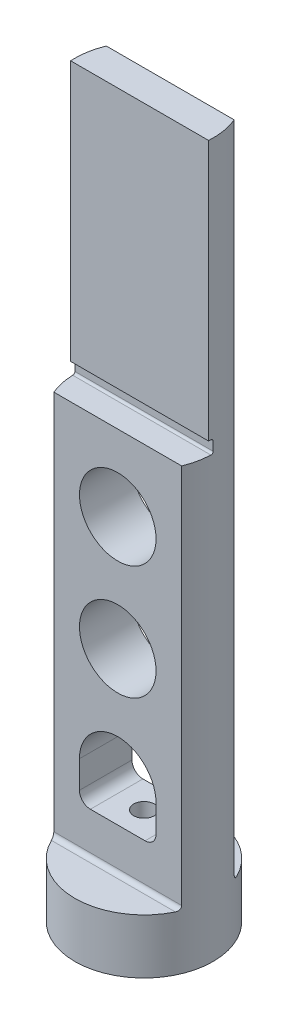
ISO-10303-21;
HEADER;
FILE_DESCRIPTION(('STEP AP214'),'2;1');
FILE_NAME('part.step','',(''),(''),'','','');
FILE_SCHEMA(('AUTOMOTIVE_DESIGN { 1 0 10303 214 1 1 1 1 }'));
ENDSEC;
DATA;
#1=APPLICATION_CONTEXT('core data for automotive mechanical design processes');
#2=APPLICATION_PROTOCOL_DEFINITION('international standard','automotive_design',2000,#1);
#3=PRODUCT_CONTEXT('',#1,'mechanical');
#4=PRODUCT('Part','Part','',(#3));
#5=PRODUCT_RELATED_PRODUCT_CATEGORY('part','',(#4));
#6=PRODUCT_DEFINITION_FORMATION('','',#4);
#7=PRODUCT_DEFINITION_CONTEXT('part definition',#1,'design');
#8=PRODUCT_DEFINITION('design','',#6,#7);
#9=PRODUCT_DEFINITION_SHAPE('','',#8);
#10=(LENGTH_UNIT() NAMED_UNIT(*) SI_UNIT(.MILLI.,.METRE.));
#11=(NAMED_UNIT(*) PLANE_ANGLE_UNIT() SI_UNIT($,.RADIAN.));
#12=(NAMED_UNIT(*) SI_UNIT($,.STERADIAN.) SOLID_ANGLE_UNIT());
#13=UNCERTAINTY_MEASURE_WITH_UNIT(LENGTH_MEASURE(1.E-05),#10,'distance_accuracy_value','');
#14=(GEOMETRIC_REPRESENTATION_CONTEXT(3) GLOBAL_UNCERTAINTY_ASSIGNED_CONTEXT((#13)) GLOBAL_UNIT_ASSIGNED_CONTEXT((#10,
#11,#12)) REPRESENTATION_CONTEXT('',''));
#15=CARTESIAN_POINT('',(0.,0.,0.));
#16=DIRECTION('',(0.,0.,1.));
#17=DIRECTION('',(1.,0.,0.));
#18=AXIS2_PLACEMENT_3D('',#15,#16,#17);
#19=CARTESIAN_POINT('',(0.,7.84225,-4.0132));
#20=DIRECTION('',(0.,0.,1.));
#21=DIRECTION('',(1.,0.,0.));
#22=AXIS2_PLACEMENT_3D('',#19,#20,#21);
#23=CYLINDRICAL_SURFACE('',#22,2.2225);
#24=DIRECTION('',(0.,0.,1.));
#25=VECTOR('',#24,1.);
#26=CARTESIAN_POINT('',(2.2225,7.84225,-4.0132));
#27=LINE('',#26,#25);
#28=CARTESIAN_POINT('',(2.2225,7.84225,-1.524));
#29=VERTEX_POINT('',#28);
#30=CARTESIAN_POINT('',(2.2225,7.84225,1.524));
#31=VERTEX_POINT('',#30);
#32=EDGE_CURVE('E450',#29,#31,#27,.T.);
#33=ORIENTED_EDGE('',*,*,#32,.T.);
#34=CARTESIAN_POINT('',(0.,7.84225,1.524));
#35=DIRECTION('',(0.,0.,1.));
#36=DIRECTION('',(1.,0.,0.));
#37=AXIS2_PLACEMENT_3D('',#34,#35,#36);
#38=CIRCLE('',#37,2.2225);
#39=CARTESIAN_POINT('',(-2.2225,7.84225,1.524));
#40=VERTEX_POINT('',#39);
#41=EDGE_CURVE('E430',#31,#40,#38,.T.);
#42=ORIENTED_EDGE('',*,*,#41,.T.);
#43=DIRECTION('',(0.,0.,1.));
#44=VECTOR('',#43,1.);
#45=CARTESIAN_POINT('',(-2.2225,7.84225,-4.0132));
#46=LINE('',#45,#44);
#47=CARTESIAN_POINT('',(-2.2225,7.84225,-1.524));
#48=VERTEX_POINT('',#47);
#49=EDGE_CURVE('E270',#40,#48,#46,.F.);
#50=ORIENTED_EDGE('',*,*,#49,.T.);
#51=CARTESIAN_POINT('',(0.,7.84225,-1.524));
#52=DIRECTION('',(0.,0.,-1.));
#53=DIRECTION('',(-1.,0.,0.));
#54=AXIS2_PLACEMENT_3D('',#51,#52,#53);
#55=CIRCLE('',#54,2.2225);
#56=EDGE_CURVE('E281',#48,#29,#55,.T.);
#57=ORIENTED_EDGE('',*,*,#56,.T.);
#58=EDGE_LOOP('',(#33,#42,#50,#57));
#59=FACE_BOUND('',#58,.T.);
#60=ADVANCED_FACE('F61',(#59),#23,.F.);
#61=CARTESIAN_POINT('',(0.,41.402,0.));
#62=DIRECTION('',(0.,1.,0.));
#63=DIRECTION('',(0.,0.,1.));
#64=AXIS2_PLACEMENT_3D('',#61,#62,#63);
#65=PLANE('',#64);
#66=DIRECTION('',(-1.,0.,0.));
#67=VECTOR('',#66,1.);
#68=CARTESIAN_POINT('',(0.,41.402,0.253999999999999));
#69=LINE('',#68,#67);
#70=CARTESIAN_POINT('',(4.00515395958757,41.402,0.253999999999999));
#71=VERTEX_POINT('',#70);
#72=CARTESIAN_POINT('',(-4.00515395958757,41.402,0.253999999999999));
#73=VERTEX_POINT('',#72);
#74=EDGE_CURVE('E419',#71,#73,#69,.T.);
#75=ORIENTED_EDGE('',*,*,#74,.F.);
#76=CARTESIAN_POINT('',(0.,41.402,0.));
#77=DIRECTION('',(0.,-1.,0.));
#78=DIRECTION('',(0.,0.,-1.));
#79=AXIS2_PLACEMENT_3D('',#76,#77,#78);
#80=CIRCLE('',#79,4.0132);
#81=CARTESIAN_POINT('',(3.71257299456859,41.402,-1.524));
#82=VERTEX_POINT('',#81);
#83=EDGE_CURVE('E427',#82,#71,#80,.T.);
#84=ORIENTED_EDGE('',*,*,#83,.F.);
#85=DIRECTION('',(1.,0.,0.));
#86=VECTOR('',#85,1.);
#87=CARTESIAN_POINT('',(0.,41.402,-1.524));
#88=LINE('',#87,#86);
#89=CARTESIAN_POINT('',(-3.71257299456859,41.402,-1.524));
#90=VERTEX_POINT('',#89);
#91=EDGE_CURVE('E365',#90,#82,#88,.T.);
#92=ORIENTED_EDGE('',*,*,#91,.F.);
#93=EDGE_CURVE('E277',#73,#90,#80,.T.);
#94=ORIENTED_EDGE('',*,*,#93,.F.);
#95=EDGE_LOOP('',(#75,#84,#92,#94));
#96=FACE_BOUND('',#95,.T.);
#97=ADVANCED_FACE('F324',(#96),#65,.T.);
#98=CARTESIAN_POINT('',(0.,41.402,1.524));
#99=DIRECTION('',(0.,0.,-1.));
#100=DIRECTION('',(-1.,0.,0.));
#101=AXIS2_PLACEMENT_3D('',#98,#99,#100);
#102=PLANE('',#101);
#103=CARTESIAN_POINT('',(0.,21.11375,1.524));
#104=DIRECTION('',(0.,0.,1.));
#105=DIRECTION('',(1.,0.,0.));
#106=AXIS2_PLACEMENT_3D('',#103,#104,#105);
#107=CIRCLE('',#106,2.2225);
#108=CARTESIAN_POINT('',(2.2225,21.11375,1.524));
#109=VERTEX_POINT('',#108);
#110=EDGE_CURVE('E284',#109,#109,#107,.T.);
#111=ORIENTED_EDGE('',*,*,#110,.F.);
#112=EDGE_LOOP('',(#111));
#113=FACE_BOUND('',#112,.T.);
#114=CARTESIAN_POINT('',(0.,14.478,1.524));
#115=DIRECTION('',(0.,0.,1.));
#116=DIRECTION('',(1.,0.,0.));
#117=AXIS2_PLACEMENT_3D('',#114,#115,#116);
#118=CIRCLE('',#117,2.2225);
#119=CARTESIAN_POINT('',(2.2225,14.478,1.524));
#120=VERTEX_POINT('',#119);
#121=EDGE_CURVE('E432',#120,#120,#118,.T.);
#122=ORIENTED_EDGE('',*,*,#121,.F.);
#123=EDGE_LOOP('',(#122));
#124=FACE_BOUND('',#123,.T.);
#125=DIRECTION('',(0.,1.,0.));
#126=VECTOR('',#125,1.);
#127=CARTESIAN_POINT('',(2.2225,0.,1.524));
#128=LINE('',#127,#126);
#129=CARTESIAN_POINT('',(2.2225,6.25475,1.524));
#130=VERTEX_POINT('',#129);
#131=EDGE_CURVE('E452',#130,#31,#128,.T.);
#132=ORIENTED_EDGE('',*,*,#131,.F.);
#133=CARTESIAN_POINT('',(1.5875,6.25475,1.524));
#134=DIRECTION('',(0.,0.,-1.));
#135=DIRECTION('',(-1.,0.,0.));
#136=AXIS2_PLACEMENT_3D('',#133,#134,#135);
#137=CIRCLE('',#136,0.635);
#138=CARTESIAN_POINT('',(1.5875,5.61975,1.524));
#139=VERTEX_POINT('',#138);
#140=EDGE_CURVE('E258',#130,#139,#137,.T.);
#141=ORIENTED_EDGE('',*,*,#140,.T.);
#142=DIRECTION('',(1.,0.,0.));
#143=VECTOR('',#142,1.);
#144=CARTESIAN_POINT('',(0.,5.61975,1.524));
#145=LINE('',#144,#143);
#146=CARTESIAN_POINT('',(-1.5875,5.61975,1.524));
#147=VERTEX_POINT('',#146);
#148=EDGE_CURVE('E442',#147,#139,#145,.T.);
#149=ORIENTED_EDGE('',*,*,#148,.F.);
#150=CARTESIAN_POINT('',(-1.5875,6.25475,1.524));
#151=DIRECTION('',(0.,0.,-1.));
#152=DIRECTION('',(-1.,0.,0.));
#153=AXIS2_PLACEMENT_3D('',#150,#151,#152);
#154=CIRCLE('',#153,0.635);
#155=CARTESIAN_POINT('',(-2.2225,6.25475,1.524));
#156=VERTEX_POINT('',#155);
#157=EDGE_CURVE('E91',#147,#156,#154,.T.);
#158=ORIENTED_EDGE('',*,*,#157,.T.);
#159=DIRECTION('',(0.,-1.,0.));
#160=VECTOR('',#159,1.);
#161=CARTESIAN_POINT('',(-2.2225,0.,1.524));
#162=LINE('',#161,#160);
#163=EDGE_CURVE('E445',#40,#156,#162,.T.);
#164=ORIENTED_EDGE('',*,*,#163,.F.);
#165=ORIENTED_EDGE('',*,*,#41,.F.);
#166=EDGE_LOOP('',(#132,#141,#149,#158,#164,#165));
#167=FACE_BOUND('',#166,.T.);
#168=DIRECTION('',(0.,-1.,0.));
#169=VECTOR('',#168,1.);
#170=CARTESIAN_POINT('',(3.71257299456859,41.402,1.524));
#171=LINE('',#170,#169);
#172=CARTESIAN_POINT('',(3.71257299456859,25.527,1.524));
#173=VERTEX_POINT('',#172);
#174=CARTESIAN_POINT('',(3.71257299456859,3.429,1.524));
#175=VERTEX_POINT('',#174);
#176=EDGE_CURVE('E383',#173,#175,#171,.T.);
#177=ORIENTED_EDGE('',*,*,#176,.F.);
#178=DIRECTION('',(1.,0.,0.));
#179=VECTOR('',#178,1.);
#180=CARTESIAN_POINT('',(0.,25.527,1.524));
#181=LINE('',#180,#179);
#182=CARTESIAN_POINT('',(-3.71257299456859,25.527,1.524));
#183=VERTEX_POINT('',#182);
#184=EDGE_CURVE('E418',#183,#173,#181,.T.);
#185=ORIENTED_EDGE('',*,*,#184,.F.);
#186=DIRECTION('',(0.,-1.,0.));
#187=VECTOR('',#186,1.);
#188=CARTESIAN_POINT('',(-3.71257299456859,41.402,1.524));
#189=LINE('',#188,#187);
#190=CARTESIAN_POINT('',(-3.71257299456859,3.429,1.524));
#191=VERTEX_POINT('',#190);
#192=EDGE_CURVE('E369',#183,#191,#189,.T.);
#193=ORIENTED_EDGE('',*,*,#192,.T.);
#194=DIRECTION('',(1.,0.,0.));
#195=VECTOR('',#194,1.);
#196=CARTESIAN_POINT('',(0.,3.429,1.524));
#197=LINE('',#196,#195);
#198=EDGE_CURVE('E391',#191,#175,#197,.T.);
#199=ORIENTED_EDGE('',*,*,#198,.T.);
#200=EDGE_LOOP('',(#177,#185,#193,#199));
#201=FACE_BOUND('',#200,.T.);
#202=ADVANCED_FACE('F330',(#113,#124,#167,#201),#102,.F.);
#203=CARTESIAN_POINT('',(0.,41.402,-1.524));
#204=DIRECTION('',(0.,0.,-1.));
#205=DIRECTION('',(-1.,0.,0.));
#206=AXIS2_PLACEMENT_3D('',#203,#204,#205);
#207=PLANE('',#206);
#208=DIRECTION('',(-1.,0.,0.));
#209=VECTOR('',#208,1.);
#210=CARTESIAN_POINT('',(0.,5.61975,-1.524));
#211=LINE('',#210,#209);
#212=CARTESIAN_POINT('',(1.5875,5.61975,-1.524));
#213=VERTEX_POINT('',#212);
#214=CARTESIAN_POINT('',(-1.5875,5.61975,-1.524));
#215=VERTEX_POINT('',#214);
#216=EDGE_CURVE('E439',#213,#215,#211,.T.);
#217=ORIENTED_EDGE('',*,*,#216,.F.);
#218=CARTESIAN_POINT('',(1.5875,6.25475,-1.524));
#219=DIRECTION('',(0.,0.,-1.));
#220=DIRECTION('',(-1.,0.,0.));
#221=AXIS2_PLACEMENT_3D('',#218,#219,#220);
#222=CIRCLE('',#221,0.635);
#223=CARTESIAN_POINT('',(2.2225,6.25475,-1.524));
#224=VERTEX_POINT('',#223);
#225=EDGE_CURVE('E256',#213,#224,#222,.F.);
#226=ORIENTED_EDGE('',*,*,#225,.T.);
#227=DIRECTION('',(0.,-1.,0.));
#228=VECTOR('',#227,1.);
#229=CARTESIAN_POINT('',(2.2225,41.402,-1.524));
#230=LINE('',#229,#228);
#231=EDGE_CURVE('E447',#29,#224,#230,.T.);
#232=ORIENTED_EDGE('',*,*,#231,.F.);
#233=ORIENTED_EDGE('',*,*,#56,.F.);
#234=DIRECTION('',(0.,1.,0.));
#235=VECTOR('',#234,1.);
#236=CARTESIAN_POINT('',(-2.2225,41.402,-1.524));
#237=LINE('',#236,#235);
#238=CARTESIAN_POINT('',(-2.2225,6.25475,-1.524));
#239=VERTEX_POINT('',#238);
#240=EDGE_CURVE('E433',#239,#48,#237,.T.);
#241=ORIENTED_EDGE('',*,*,#240,.F.);
#242=CARTESIAN_POINT('',(-1.5875,6.25475,-1.524));
#243=DIRECTION('',(0.,0.,-1.));
#244=DIRECTION('',(-1.,0.,0.));
#245=AXIS2_PLACEMENT_3D('',#242,#243,#244);
#246=CIRCLE('',#245,0.635);
#247=EDGE_CURVE('E253',#239,#215,#246,.F.);
#248=ORIENTED_EDGE('',*,*,#247,.T.);
#249=EDGE_LOOP('',(#217,#226,#232,#233,#241,#248));
#250=FACE_BOUND('',#249,.T.);
#251=CARTESIAN_POINT('',(0.,21.11375,-1.524));
#252=DIRECTION('',(0.,0.,-1.));
#253=DIRECTION('',(-1.,0.,0.));
#254=AXIS2_PLACEMENT_3D('',#251,#252,#253);
#255=CIRCLE('',#254,2.2225);
#256=CARTESIAN_POINT('',(-2.2225,21.11375,-1.524));
#257=VERTEX_POINT('',#256);
#258=EDGE_CURVE('E274',#257,#257,#255,.T.);
#259=ORIENTED_EDGE('',*,*,#258,.F.);
#260=EDGE_LOOP('',(#259));
#261=FACE_BOUND('',#260,.T.);
#262=CARTESIAN_POINT('',(0.,14.478,-1.524));
#263=DIRECTION('',(0.,0.,-1.));
#264=DIRECTION('',(-1.,0.,0.));
#265=AXIS2_PLACEMENT_3D('',#262,#263,#264);
#266=CIRCLE('',#265,2.2225);
#267=CARTESIAN_POINT('',(-2.2225,14.478,-1.524));
#268=VERTEX_POINT('',#267);
#269=EDGE_CURVE('E278',#268,#268,#266,.T.);
#270=ORIENTED_EDGE('',*,*,#269,.F.);
#271=EDGE_LOOP('',(#270));
#272=FACE_BOUND('',#271,.T.);
#273=ORIENTED_EDGE('',*,*,#91,.T.);
#274=DIRECTION('',(0.,-1.,0.));
#275=VECTOR('',#274,1.);
#276=CARTESIAN_POINT('',(3.71257299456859,41.402,-1.524));
#277=LINE('',#276,#275);
#278=CARTESIAN_POINT('',(3.71257299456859,3.429,-1.524));
#279=VERTEX_POINT('',#278);
#280=EDGE_CURVE('E380',#82,#279,#277,.T.);
#281=ORIENTED_EDGE('',*,*,#280,.T.);
#282=DIRECTION('',(1.,0.,0.));
#283=VECTOR('',#282,1.);
#284=CARTESIAN_POINT('',(-3.71257299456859,3.429,-1.524));
#285=LINE('',#284,#283);
#286=CARTESIAN_POINT('',(-3.71257299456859,3.429,-1.524));
#287=VERTEX_POINT('',#286);
#288=EDGE_CURVE('E389',#279,#287,#285,.F.);
#289=ORIENTED_EDGE('',*,*,#288,.T.);
#290=DIRECTION('',(0.,-1.,0.));
#291=VECTOR('',#290,1.);
#292=CARTESIAN_POINT('',(-3.71257299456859,41.402,-1.524));
#293=LINE('',#292,#291);
#294=EDGE_CURVE('E377',#90,#287,#293,.T.);
#295=ORIENTED_EDGE('',*,*,#294,.F.);
#296=EDGE_LOOP('',(#273,#281,#289,#295));
#297=FACE_BOUND('',#296,.T.);
#298=ADVANCED_FACE('F344',(#250,#261,#272,#297),#207,.T.);
#299=CARTESIAN_POINT('',(0.,25.527,0.253999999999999));
#300=DIRECTION('',(0.,-1.,0.));
#301=DIRECTION('',(0.,0.,-1.));
#302=AXIS2_PLACEMENT_3D('',#299,#300,#301);
#303=PLANE('',#302);
#304=CARTESIAN_POINT('',(0.,25.527,0.));
#305=DIRECTION('',(0.,-1.,0.));
#306=DIRECTION('',(0.,0.,-1.));
#307=AXIS2_PLACEMENT_3D('',#304,#305,#306);
#308=CIRCLE('',#307,4.0132);
#309=CARTESIAN_POINT('',(4.01119000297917,25.527,0.126999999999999));
#310=VERTEX_POINT('',#309);
#311=EDGE_CURVE('E424',#310,#173,#308,.T.);
#312=ORIENTED_EDGE('',*,*,#311,.F.);
#313=DIRECTION('',(1.,0.,0.));
#314=VECTOR('',#313,1.);
#315=CARTESIAN_POINT('',(-4.0132,25.527,0.126999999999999));
#316=LINE('',#315,#314);
#317=CARTESIAN_POINT('',(-4.01119000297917,25.527,0.126999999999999));
#318=VERTEX_POINT('',#317);
#319=EDGE_CURVE('E459',#318,#310,#316,.T.);
#320=ORIENTED_EDGE('',*,*,#319,.F.);
#321=EDGE_CURVE('E420',#183,#318,#308,.T.);
#322=ORIENTED_EDGE('',*,*,#321,.F.);
#323=ORIENTED_EDGE('',*,*,#184,.T.);
#324=EDGE_LOOP('',(#312,#320,#322,#323));
#325=FACE_BOUND('',#324,.T.);
#326=ADVANCED_FACE('F340',(#325),#303,.F.);
#327=CARTESIAN_POINT('',(0.,0.,0.253999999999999));
#328=DIRECTION('',(0.,0.,1.));
#329=DIRECTION('',(1.,0.,0.));
#330=AXIS2_PLACEMENT_3D('',#327,#328,#329);
#331=PLANE('',#330);
#332=DIRECTION('',(1.,0.,0.));
#333=VECTOR('',#332,1.);
#334=CARTESIAN_POINT('',(-4.0132,26.289,0.253999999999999));
#335=LINE('',#334,#333);
#336=CARTESIAN_POINT('',(-4.00515395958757,26.289,0.253999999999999));
#337=VERTEX_POINT('',#336);
#338=CARTESIAN_POINT('',(4.00515395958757,26.289,0.253999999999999));
#339=VERTEX_POINT('',#338);
#340=EDGE_CURVE('E458',#337,#339,#335,.T.);
#341=ORIENTED_EDGE('',*,*,#340,.T.);
#342=DIRECTION('',(0.,-1.,0.));
#343=VECTOR('',#342,1.);
#344=CARTESIAN_POINT('',(4.00515395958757,41.402,0.253999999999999));
#345=LINE('',#344,#343);
#346=EDGE_CURVE('E286',#339,#71,#345,.F.);
#347=ORIENTED_EDGE('',*,*,#346,.T.);
#348=ORIENTED_EDGE('',*,*,#74,.T.);
#349=DIRECTION('',(0.,-1.,0.));
#350=VECTOR('',#349,1.);
#351=CARTESIAN_POINT('',(-4.00515395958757,41.402,0.253999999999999));
#352=LINE('',#351,#350);
#353=EDGE_CURVE('E273',#73,#337,#352,.T.);
#354=ORIENTED_EDGE('',*,*,#353,.T.);
#355=EDGE_LOOP('',(#341,#347,#348,#354));
#356=FACE_BOUND('',#355,.T.);
#357=ADVANCED_FACE('F337',(#356),#331,.T.);
#358=CARTESIAN_POINT('',(0.,41.402,0.));
#359=DIRECTION('',(0.,-1.,0.));
#360=DIRECTION('',(0.,0.,-1.));
#361=AXIS2_PLACEMENT_3D('',#358,#359,#360);
#362=CYLINDRICAL_SURFACE('',#361,4.0132);
#363=ORIENTED_EDGE('',*,*,#346,.F.);
#364=CARTESIAN_POINT('',(0.,26.289,0.));
#365=DIRECTION('',(0.,1.,0.));
#366=DIRECTION('',(0.,0.,1.));
#367=AXIS2_PLACEMENT_3D('',#364,#365,#366);
#368=CIRCLE('',#367,4.0132);
#369=CARTESIAN_POINT('',(4.01119000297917,26.289,0.126999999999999));
#370=VERTEX_POINT('',#369);
#371=EDGE_CURVE('E12',#339,#370,#368,.T.);
#372=ORIENTED_EDGE('',*,*,#371,.T.);
#373=CARTESIAN_POINT('',(4.01119000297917,26.289,0.126999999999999));
#374=CARTESIAN_POINT('',(4.01141682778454,26.2890060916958,0.119859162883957));
#375=CARTESIAN_POINT('',(4.01162307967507,26.2883980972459,0.112719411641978));
#376=CARTESIAN_POINT('',(4.01199341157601,26.2859981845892,0.0986460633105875));
#377=CARTESIAN_POINT('',(4.01215752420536,26.2842071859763,0.0917123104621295));
#378=CARTESIAN_POINT('',(4.01244297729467,26.2794842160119,0.0782398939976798));
#379=CARTESIAN_POINT('',(4.0125642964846,26.2765516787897,0.0717014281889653));
#380=CARTESIAN_POINT('',(4.01276804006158,26.2696312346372,0.0592101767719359));
#381=CARTESIAN_POINT('',(4.01285047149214,26.2656435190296,0.0532572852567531));
#382=CARTESIAN_POINT('',(4.01298298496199,26.2567263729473,0.0421066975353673));
#383=CARTESIAN_POINT('',(4.01303307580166,26.2517971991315,0.0369087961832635));
#384=CARTESIAN_POINT('',(4.01310919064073,26.2411351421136,0.0274128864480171));
#385=CARTESIAN_POINT('',(4.01313520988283,26.2354021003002,0.0231150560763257));
#386=CARTESIAN_POINT('',(4.01317170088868,26.2232946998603,0.0155415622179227));
#387=CARTESIAN_POINT('',(4.01318216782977,26.2169201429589,0.0122662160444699));
#388=CARTESIAN_POINT('',(4.01319510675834,26.2037129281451,0.0068336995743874));
#389=CARTESIAN_POINT('',(4.01319758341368,26.1968805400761,0.00467587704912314));
#390=CARTESIAN_POINT('',(4.01319959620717,26.1853388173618,0.00207443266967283));
#391=CARTESIAN_POINT('',(4.01319984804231,26.1807019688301,0.00129699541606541));
#392=CARTESIAN_POINT('',(4.01320000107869,26.1713773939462,0.00025984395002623));
#393=CARTESIAN_POINT('',(4.01319990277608,26.1666897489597,-6.02005153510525E-07));
#394=CARTESIAN_POINT('',(4.01320000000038,26.1620000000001,-6.13837127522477E-13));
#395=B_SPLINE_CURVE_WITH_KNOTS('',3,(#373,#374,#375,#376,#377,#378,#379,#380,#381,#382,#383,
#384,#385,#386,#387,#388,#389,#390,#391,#392,#393,#394),.UNSPECIFIED.,.F.,.F.,(4,2,2,2,2,2,2,2,
2,2,4),(0.,0.0214049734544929,0.0427933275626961,0.0641922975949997,0.0855873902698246,
0.106976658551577,0.128370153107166,0.149770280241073,0.171157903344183,0.185235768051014,
0.199293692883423),.UNSPECIFIED.);
#396=CARTESIAN_POINT('',(4.0132,26.162,0.));
#397=VERTEX_POINT('',#396);
#398=EDGE_CURVE('E65',#370,#397,#395,.T.);
#399=ORIENTED_EDGE('',*,*,#398,.T.);
#400=DIRECTION('',(0.,1.,0.));
#401=VECTOR('',#400,1.);
#402=CARTESIAN_POINT('',(4.0132,26.162,0.));
#403=LINE('',#402,#401);
#404=CARTESIAN_POINT('',(4.0132,25.654,0.));
#405=VERTEX_POINT('',#404);
#406=EDGE_CURVE('E205',#405,#397,#403,.T.);
#407=ORIENTED_EDGE('',*,*,#406,.F.);
#408=CARTESIAN_POINT('',(4.0132,25.654,0.));
#409=CARTESIAN_POINT('',(4.01319945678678,25.6468552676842,-6.06817025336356E-06));
#410=CARTESIAN_POINT('',(4.01319999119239,25.6397123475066,0.000602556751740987));
#411=CARTESIAN_POINT('',(4.01319919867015,25.6256340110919,0.0030044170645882));
#412=CARTESIAN_POINT('',(4.01319787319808,25.6186984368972,0.00479672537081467));
#413=CARTESIAN_POINT('',(4.01318935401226,25.6052236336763,0.00952244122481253));
#414=CARTESIAN_POINT('',(4.01318215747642,25.5986845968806,0.0124563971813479));
#415=CARTESIAN_POINT('',(4.01315470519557,25.5861929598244,0.0193795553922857));
#416=CARTESIAN_POINT('',(4.01313445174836,25.5802402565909,0.0233685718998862));
#417=CARTESIAN_POINT('',(4.01307257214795,25.5690893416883,0.0322890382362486));
#418=CARTESIAN_POINT('',(4.01303094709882,25.5638910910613,0.0372204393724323));
#419=CARTESIAN_POINT('',(4.01291782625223,25.5543953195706,0.047886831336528));
#420=CARTESIAN_POINT('',(4.01284632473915,25.5500979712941,0.0536219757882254));
#421=CARTESIAN_POINT('',(4.0126662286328,25.5425273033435,0.0657313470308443));
#422=CARTESIAN_POINT('',(4.01255763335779,25.5392540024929,0.0721055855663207));
#423=CARTESIAN_POINT('',(4.01229856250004,25.5338254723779,0.0853110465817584));
#424=CARTESIAN_POINT('',(4.01214811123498,25.5316695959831,0.0921420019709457));
#425=CARTESIAN_POINT('',(4.01186315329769,25.5290712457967,0.103678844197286));
#426=CARTESIAN_POINT('',(4.01174078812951,25.5282949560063,0.108312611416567));
#427=CARTESIAN_POINT('',(4.0114784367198,25.5272593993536,0.117630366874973));
#428=CARTESIAN_POINT('',(4.01133847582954,25.5269993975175,0.122314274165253));
#429=CARTESIAN_POINT('',(4.01119000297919,25.5269999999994,0.126999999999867));
#430=B_SPLINE_CURVE_WITH_KNOTS('',3,(#408,#409,#410,#411,#412,#413,#414,#415,#416,#417,#418,
#419,#420,#421,#422,#423,#424,#425,#426,#427,#428,#429),.UNSPECIFIED.,.F.,.F.,(4,2,2,2,2,2,2,2,
2,2,4),(0.,0.021405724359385,0.0427947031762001,0.0641939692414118,0.085589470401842,
0.106983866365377,0.128382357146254,0.149781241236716,0.171167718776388,0.185240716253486,
0.19929366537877),.UNSPECIFIED.);
#431=EDGE_CURVE('E247',#405,#310,#430,.T.);
#432=ORIENTED_EDGE('',*,*,#431,.T.);
#433=ORIENTED_EDGE('',*,*,#311,.T.);
#434=ORIENTED_EDGE('',*,*,#176,.T.);
#435=CARTESIAN_POINT('',(3.71257299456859,3.429,1.524));
#436=CARTESIAN_POINT('',(3.71257715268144,3.41551927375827,1.52398474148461));
#437=CARTESIAN_POINT('',(3.71213285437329,3.40204735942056,1.52507217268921));
#438=CARTESIAN_POINT('',(3.7103801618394,3.37553056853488,1.52933406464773));
#439=CARTESIAN_POINT('',(3.70907403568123,3.36248466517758,1.53250304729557));
#440=CARTESIAN_POINT('',(3.70563044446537,3.33715651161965,1.54081021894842));
#441=CARTESIAN_POINT('',(3.7034930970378,3.32487415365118,1.54594812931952));
#442=CARTESIAN_POINT('',(3.6984428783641,3.3013816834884,1.55799142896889));
#443=CARTESIAN_POINT('',(3.69552974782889,3.29017193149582,1.56489740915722));
#444=CARTESIAN_POINT('',(3.68890971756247,3.26879495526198,1.58044053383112));
#445=CARTESIAN_POINT('',(3.68518340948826,3.25866431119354,1.58911959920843));
#446=CARTESIAN_POINT('',(3.67707618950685,3.24000570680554,1.6077899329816));
#447=CARTESIAN_POINT('',(3.67269517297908,3.23147800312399,1.61778141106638));
#448=CARTESIAN_POINT('',(3.66304461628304,3.21561492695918,1.63952104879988));
#449=CARTESIAN_POINT('',(3.65773416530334,3.20840639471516,1.65134345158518));
#450=CARTESIAN_POINT('',(3.64659200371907,3.19606199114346,1.67580490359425));
#451=CARTESIAN_POINT('',(3.64075986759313,3.19092783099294,1.68844461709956));
#452=CARTESIAN_POINT('',(3.6288710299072,3.18288545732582,1.71384340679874));
#453=CARTESIAN_POINT('',(3.62282511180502,3.17991921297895,1.72658934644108));
#454=CARTESIAN_POINT('',(3.61049079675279,3.17597687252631,1.75223774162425));
#455=CARTESIAN_POINT('',(3.60420293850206,3.17499658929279,1.76513981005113));
#456=CARTESIAN_POINT('',(3.59784522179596,3.175,1.778));
#457=B_SPLINE_CURVE_WITH_KNOTS('',3,(#435,#436,#437,#438,#439,#440,#441,#442,#443,#444,#445,
#446,#447,#448,#449,#450,#451,#452,#453,#454,#455,#456),.UNSPECIFIED.,.F.,.F.,(4,2,2,2,2,2,2,2,
2,2,4),(0.,0.0403774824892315,0.0806491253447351,0.120915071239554,0.161194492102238,
0.202567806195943,0.243947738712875,0.288251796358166,0.332592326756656,0.375697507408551,
0.418711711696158),.UNSPECIFIED.);
#458=CARTESIAN_POINT('',(3.59784522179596,3.175,1.778));
#459=VERTEX_POINT('',#458);
#460=EDGE_CURVE('E295',#175,#459,#457,.T.);
#461=ORIENTED_EDGE('',*,*,#460,.T.);
#462=CARTESIAN_POINT('',(0.,3.175,0.));
#463=DIRECTION('',(0.,1.,0.));
#464=DIRECTION('',(0.,0.,1.));
#465=AXIS2_PLACEMENT_3D('',#462,#463,#464);
#466=CIRCLE('',#465,4.0132);
#467=CARTESIAN_POINT('',(-3.59784522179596,3.175,1.778));
#468=VERTEX_POINT('',#467);
#469=EDGE_CURVE('E366',#468,#459,#466,.T.);
#470=ORIENTED_EDGE('',*,*,#469,.F.);
#471=CARTESIAN_POINT('',(-3.59784522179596,3.175,1.778));
#472=CARTESIAN_POINT('',(-3.60536795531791,3.17499223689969,1.76278719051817));
#473=CARTESIAN_POINT('',(-3.6127930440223,3.17636711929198,1.74750982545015));
#474=CARTESIAN_POINT('',(-3.62728220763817,3.18189776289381,1.7172278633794));
#475=CARTESIAN_POINT('',(-3.6343449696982,3.18606296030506,1.70222437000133));
#476=CARTESIAN_POINT('',(-3.64790582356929,3.19720297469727,1.67296752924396));
#477=CARTESIAN_POINT('',(-3.6544025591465,3.20418432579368,1.65871601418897));
#478=CARTESIAN_POINT('',(-3.66661230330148,3.22086247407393,1.63154816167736));
#479=CARTESIAN_POINT('',(-3.67232654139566,3.23055493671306,1.61862973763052));
#480=CARTESIAN_POINT('',(-3.68242307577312,3.25167462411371,1.59551957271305));
#481=CARTESIAN_POINT('',(-3.68687122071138,3.26292930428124,1.585199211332));
#482=CARTESIAN_POINT('',(-3.69480458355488,3.28733502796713,1.56661919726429));
#483=CARTESIAN_POINT('',(-3.69828984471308,3.30048598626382,1.55835945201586));
#484=CARTESIAN_POINT('',(-3.7039133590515,3.32701309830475,1.54494283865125));
#485=CARTESIAN_POINT('',(-3.7061445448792,3.34026270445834,1.5395737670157));
#486=CARTESIAN_POINT('',(-3.70964303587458,3.36758133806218,1.53112509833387));
#487=CARTESIAN_POINT('',(-3.71091213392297,3.38164878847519,1.52804124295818));
#488=CARTESIAN_POINT('',(-3.71197915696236,3.40137150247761,1.52544595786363));
#489=CARTESIAN_POINT('',(-3.71220190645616,3.40688535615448,1.52490373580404));
#490=CARTESIAN_POINT('',(-3.71249863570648,3.41793185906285,1.52418117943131));
#491=CARTESIAN_POINT('',(-3.71257285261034,3.42346446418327,1.52400026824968));
#492=CARTESIAN_POINT('',(-3.71257299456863,3.429,1.52399999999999));
#493=B_SPLINE_CURVE_WITH_KNOTS('',3,(#471,#472,#473,#474,#475,#476,#477,#478,#479,#480,#481,
#482,#483,#484,#485,#486,#487,#488,#489,#490,#491,#492),.UNSPECIFIED.,.F.,.F.,(4,2,2,2,2,2,2,2,
2,2,4),(0.,0.0508807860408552,0.101934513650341,0.153107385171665,0.20419890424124,
0.251654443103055,0.299107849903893,0.342294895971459,0.385401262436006,0.402025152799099,
0.418622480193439),.UNSPECIFIED.);
#494=EDGE_CURVE('E288',#468,#191,#493,.T.);
#495=ORIENTED_EDGE('',*,*,#494,.T.);
#496=ORIENTED_EDGE('',*,*,#192,.F.);
#497=ORIENTED_EDGE('',*,*,#321,.T.);
#498=CARTESIAN_POINT('',(-4.01119000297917,25.527,0.126999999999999));
#499=CARTESIAN_POINT('',(-4.01141682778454,25.5269939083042,0.119859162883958));
#500=CARTESIAN_POINT('',(-4.01162307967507,25.5276019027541,0.112719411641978));
#501=CARTESIAN_POINT('',(-4.01199341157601,25.5300018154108,0.0986460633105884));
#502=CARTESIAN_POINT('',(-4.01215752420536,25.5317928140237,0.0917123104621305));
#503=CARTESIAN_POINT('',(-4.01244297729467,25.5365157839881,0.0782398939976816));
#504=CARTESIAN_POINT('',(-4.0125642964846,25.5394483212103,0.0717014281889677));
#505=CARTESIAN_POINT('',(-4.01276804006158,25.5463687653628,0.0592101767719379));
#506=CARTESIAN_POINT('',(-4.01285047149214,25.5503564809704,0.0532572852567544));
#507=CARTESIAN_POINT('',(-4.01298298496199,25.5592736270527,0.0421066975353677));
#508=CARTESIAN_POINT('',(-4.01303307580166,25.5642028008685,0.0369087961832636));
#509=CARTESIAN_POINT('',(-4.01310919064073,25.5748648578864,0.027412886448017));
#510=CARTESIAN_POINT('',(-4.01313520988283,25.5805978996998,0.0231150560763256));
#511=CARTESIAN_POINT('',(-4.01317170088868,25.5927053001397,0.0155415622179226));
#512=CARTESIAN_POINT('',(-4.01318216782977,25.5990798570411,0.0122662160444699));
#513=CARTESIAN_POINT('',(-4.01319510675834,25.6122870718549,0.00683369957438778));
#514=CARTESIAN_POINT('',(-4.01319758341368,25.6191194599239,0.00467587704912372));
#515=CARTESIAN_POINT('',(-4.01319959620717,25.6306611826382,0.00207443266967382));
#516=CARTESIAN_POINT('',(-4.01319984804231,25.6352980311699,0.00129699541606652));
#517=CARTESIAN_POINT('',(-4.01320000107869,25.6446226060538,0.00025984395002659));
#518=CARTESIAN_POINT('',(-4.01319990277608,25.6493102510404,-6.02005153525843E-07));
#519=CARTESIAN_POINT('',(-4.01320000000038,25.6539999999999,-6.13966311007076E-13));
#520=B_SPLINE_CURVE_WITH_KNOTS('',3,(#498,#499,#500,#501,#502,#503,#504,#505,#506,#507,#508,
#509,#510,#511,#512,#513,#514,#515,#516,#517,#518,#519),.UNSPECIFIED.,.F.,.F.,(4,2,2,2,2,2,2,2,
2,2,4),(0.,0.0214049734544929,0.042793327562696,0.0641922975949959,0.0855873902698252,
0.106976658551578,0.128370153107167,0.149770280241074,0.17115790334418,0.185235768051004,
0.199293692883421),.UNSPECIFIED.);
#521=CARTESIAN_POINT('',(-4.0132,25.654,0.));
#522=VERTEX_POINT('',#521);
#523=EDGE_CURVE('E216',#318,#522,#520,.T.);
#524=ORIENTED_EDGE('',*,*,#523,.T.);
#525=DIRECTION('',(0.,1.,0.));
#526=VECTOR('',#525,1.);
#527=CARTESIAN_POINT('',(-4.0132,26.162,0.));
#528=LINE('',#527,#526);
#529=CARTESIAN_POINT('',(-4.0132,26.162,0.));
#530=VERTEX_POINT('',#529);
#531=EDGE_CURVE('E209',#522,#530,#528,.T.);
#532=ORIENTED_EDGE('',*,*,#531,.T.);
#533=CARTESIAN_POINT('',(-4.0132,26.162,0.));
#534=CARTESIAN_POINT('',(-4.01319945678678,26.1691447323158,-6.06817025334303E-06));
#535=CARTESIAN_POINT('',(-4.01319999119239,26.1762876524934,0.000602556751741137));
#536=CARTESIAN_POINT('',(-4.01319919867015,26.1903659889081,0.00300441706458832));
#537=CARTESIAN_POINT('',(-4.01319787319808,26.1973015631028,0.00479672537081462));
#538=CARTESIAN_POINT('',(-4.01318935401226,26.2107763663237,0.00952244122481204));
#539=CARTESIAN_POINT('',(-4.01318215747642,26.2173154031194,0.0124563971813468));
#540=CARTESIAN_POINT('',(-4.01315470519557,26.2298070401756,0.0193795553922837));
#541=CARTESIAN_POINT('',(-4.01313445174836,26.2357597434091,0.0233685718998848));
#542=CARTESIAN_POINT('',(-4.01307257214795,26.2469106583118,0.032289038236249));
#543=CARTESIAN_POINT('',(-4.01303094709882,26.2521089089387,0.0372204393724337));
#544=CARTESIAN_POINT('',(-4.01291782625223,26.2616046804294,0.0478868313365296));
#545=CARTESIAN_POINT('',(-4.01284632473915,26.2659020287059,0.0536219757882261));
#546=CARTESIAN_POINT('',(-4.0126662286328,26.2734726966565,0.0657313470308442));
#547=CARTESIAN_POINT('',(-4.01255763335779,26.2767459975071,0.0721055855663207));
#548=CARTESIAN_POINT('',(-4.01229856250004,26.2821745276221,0.0853110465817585));
#549=CARTESIAN_POINT('',(-4.01214811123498,26.2843304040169,0.0921420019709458));
#550=CARTESIAN_POINT('',(-4.01186315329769,26.2869287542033,0.103678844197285));
#551=CARTESIAN_POINT('',(-4.01174078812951,26.2877050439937,0.108312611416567));
#552=CARTESIAN_POINT('',(-4.0114784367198,26.2887406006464,0.117630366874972));
#553=CARTESIAN_POINT('',(-4.01133847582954,26.2890006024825,0.122314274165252));
#554=CARTESIAN_POINT('',(-4.01119000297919,26.2890000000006,0.126999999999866));
#555=B_SPLINE_CURVE_WITH_KNOTS('',3,(#533,#534,#535,#536,#537,#538,#539,#540,#541,#542,#543,
#544,#545,#546,#547,#548,#549,#550,#551,#552,#553,#554),.UNSPECIFIED.,.F.,.F.,(4,2,2,2,2,2,2,2,
2,2,4),(0.,0.0214057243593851,0.0427947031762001,0.0641939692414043,0.0855894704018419,
0.106983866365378,0.128382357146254,0.149781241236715,0.171167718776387,0.185240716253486,
0.199293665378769),.UNSPECIFIED.);
#556=CARTESIAN_POINT('',(-4.01119000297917,26.289,0.126999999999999));
#557=VERTEX_POINT('',#556);
#558=EDGE_CURVE('E200',#530,#557,#555,.T.);
#559=ORIENTED_EDGE('',*,*,#558,.T.);
#560=EDGE_CURVE('E76',#557,#337,#368,.T.);
#561=ORIENTED_EDGE('',*,*,#560,.T.);
#562=ORIENTED_EDGE('',*,*,#353,.F.);
#563=ORIENTED_EDGE('',*,*,#93,.T.);
#564=ORIENTED_EDGE('',*,*,#294,.T.);
#565=CARTESIAN_POINT('',(-3.71257299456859,3.429,-1.524));
#566=CARTESIAN_POINT('',(-3.71257715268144,3.41551927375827,-1.52398474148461));
#567=CARTESIAN_POINT('',(-3.71213285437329,3.40204735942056,-1.52507217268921));
#568=CARTESIAN_POINT('',(-3.7103801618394,3.37553056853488,-1.52933406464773));
#569=CARTESIAN_POINT('',(-3.70907403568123,3.36248466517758,-1.53250304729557));
#570=CARTESIAN_POINT('',(-3.70563044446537,3.33715651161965,-1.54081021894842));
#571=CARTESIAN_POINT('',(-3.7034930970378,3.32487415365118,-1.54594812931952));
#572=CARTESIAN_POINT('',(-3.6984428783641,3.3013816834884,-1.5579914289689));
#573=CARTESIAN_POINT('',(-3.69552974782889,3.29017193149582,-1.56489740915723));
#574=CARTESIAN_POINT('',(-3.68890971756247,3.26879495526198,-1.58044053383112));
#575=CARTESIAN_POINT('',(-3.68518340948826,3.25866431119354,-1.58911959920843));
#576=CARTESIAN_POINT('',(-3.67707618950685,3.24000570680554,-1.6077899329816));
#577=CARTESIAN_POINT('',(-3.67269517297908,3.23147800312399,-1.61778141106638));
#578=CARTESIAN_POINT('',(-3.66304461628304,3.21561492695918,-1.63952104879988));
#579=CARTESIAN_POINT('',(-3.65773416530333,3.20840639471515,-1.65134345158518));
#580=CARTESIAN_POINT('',(-3.64659200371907,3.19606199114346,-1.67580490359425));
#581=CARTESIAN_POINT('',(-3.64075986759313,3.19092783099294,-1.68844461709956));
#582=CARTESIAN_POINT('',(-3.6288710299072,3.18288545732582,-1.71384340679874));
#583=CARTESIAN_POINT('',(-3.62282511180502,3.17991921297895,-1.72658934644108));
#584=CARTESIAN_POINT('',(-3.61049079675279,3.17597687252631,-1.75223774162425));
#585=CARTESIAN_POINT('',(-3.60420293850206,3.17499658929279,-1.76513981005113));
#586=CARTESIAN_POINT('',(-3.59784522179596,3.175,-1.778));
#587=B_SPLINE_CURVE_WITH_KNOTS('',3,(#565,#566,#567,#568,#569,#570,#571,#572,#573,#574,#575,
#576,#577,#578,#579,#580,#581,#582,#583,#584,#585,#586),.UNSPECIFIED.,.F.,.F.,(4,2,2,2,2,2,2,2,
2,2,4),(0.,0.0403774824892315,0.0806491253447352,0.120915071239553,0.161194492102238,
0.202567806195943,0.243947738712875,0.288251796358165,0.332592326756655,0.375697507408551,
0.418711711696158),.UNSPECIFIED.);
#588=CARTESIAN_POINT('',(-3.59784522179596,3.175,-1.778));
#589=VERTEX_POINT('',#588);
#590=EDGE_CURVE('E401',#287,#589,#587,.T.);
#591=ORIENTED_EDGE('',*,*,#590,.T.);
#592=CARTESIAN_POINT('',(3.59784522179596,3.175,-1.778));
#593=VERTEX_POINT('',#592);
#594=EDGE_CURVE('E372',#593,#589,#466,.T.);
#595=ORIENTED_EDGE('',*,*,#594,.F.);
#596=CARTESIAN_POINT('',(3.59784522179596,3.175,-1.778));
#597=CARTESIAN_POINT('',(3.60536795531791,3.17499223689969,-1.76278719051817));
#598=CARTESIAN_POINT('',(3.6127930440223,3.17636711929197,-1.74750982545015));
#599=CARTESIAN_POINT('',(3.62728220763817,3.1818977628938,-1.7172278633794));
#600=CARTESIAN_POINT('',(3.6343449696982,3.18606296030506,-1.70222437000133));
#601=CARTESIAN_POINT('',(3.64790582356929,3.19720297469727,-1.67296752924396));
#602=CARTESIAN_POINT('',(3.6544025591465,3.20418432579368,-1.65871601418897));
#603=CARTESIAN_POINT('',(3.66661230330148,3.22086247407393,-1.63154816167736));
#604=CARTESIAN_POINT('',(3.67232654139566,3.23055493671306,-1.61862973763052));
#605=CARTESIAN_POINT('',(3.68242307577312,3.2516746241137,-1.59551957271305));
#606=CARTESIAN_POINT('',(3.68687122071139,3.26292930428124,-1.585199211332));
#607=CARTESIAN_POINT('',(3.69480458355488,3.28733502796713,-1.56661919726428));
#608=CARTESIAN_POINT('',(3.69828984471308,3.30048598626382,-1.55835945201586));
#609=CARTESIAN_POINT('',(3.7039133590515,3.32701309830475,-1.54494283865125));
#610=CARTESIAN_POINT('',(3.7061445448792,3.34026270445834,-1.5395737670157));
#611=CARTESIAN_POINT('',(3.70964303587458,3.36758133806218,-1.53112509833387));
#612=CARTESIAN_POINT('',(3.71091213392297,3.38164878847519,-1.52804124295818));
#613=CARTESIAN_POINT('',(3.71197915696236,3.40137150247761,-1.52544595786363));
#614=CARTESIAN_POINT('',(3.71220190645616,3.40688535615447,-1.52490373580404));
#615=CARTESIAN_POINT('',(3.71249863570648,3.41793185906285,-1.5241811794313));
#616=CARTESIAN_POINT('',(3.71257285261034,3.42346446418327,-1.52400026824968));
#617=CARTESIAN_POINT('',(3.71257299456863,3.429,-1.52399999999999));
#618=B_SPLINE_CURVE_WITH_KNOTS('',3,(#596,#597,#598,#599,#600,#601,#602,#603,#604,#605,#606,
#607,#608,#609,#610,#611,#612,#613,#614,#615,#616,#617),.UNSPECIFIED.,.F.,.F.,(4,2,2,2,2,2,2,2,
2,2,4),(0.,0.0508807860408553,0.10193451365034,0.153107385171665,0.204198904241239,
0.251654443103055,0.299107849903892,0.342294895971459,0.385401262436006,0.402025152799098,
0.418622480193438),.UNSPECIFIED.);
#619=EDGE_CURVE('E396',#593,#279,#618,.T.);
#620=ORIENTED_EDGE('',*,*,#619,.T.);
#621=ORIENTED_EDGE('',*,*,#280,.F.);
#622=ORIENTED_EDGE('',*,*,#83,.T.);
#623=EDGE_LOOP('',(#363,#372,#399,#407,#432,#433,#434,#461,#470,#495,#496,#497,#524,#532,#559,
#561,#562,#563,#564,#591,#595,#620,#621,#622));
#624=FACE_BOUND('',#623,.T.);
#625=CARTESIAN_POINT('',(0.,0.,0.));
#626=DIRECTION('',(0.,1.,0.));
#627=DIRECTION('',(0.,0.,1.));
#628=AXIS2_PLACEMENT_3D('',#625,#626,#627);
#629=CIRCLE('',#628,4.0132);
#630=CARTESIAN_POINT('',(0.,0.,4.0132));
#631=VERTEX_POINT('',#630);
#632=EDGE_CURVE('E364',#631,#631,#629,.T.);
#633=ORIENTED_EDGE('',*,*,#632,.T.);
#634=EDGE_LOOP('',(#633));
#635=FACE_BOUND('',#634,.T.);
#636=ADVANCED_FACE('F212',(#624,#635),#362,.T.);
#637=CARTESIAN_POINT('',(0.,0.,0.));
#638=DIRECTION('',(0.,1.,0.));
#639=DIRECTION('',(0.,0.,1.));
#640=AXIS2_PLACEMENT_3D('',#637,#638,#639);
#641=PLANE('',#640);
#642=CARTESIAN_POINT('',(0.,0.,0.));
#643=DIRECTION('',(0.,-1.,0.));
#644=DIRECTION('',(0.,0.,-1.));
#645=AXIS2_PLACEMENT_3D('',#642,#643,#644);
#646=CIRCLE('',#645,0.595629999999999);
#647=CARTESIAN_POINT('',(0.,0.,-0.595629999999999));
#648=VERTEX_POINT('',#647);
#649=EDGE_CURVE('E361',#648,#648,#646,.T.);
#650=ORIENTED_EDGE('',*,*,#649,.F.);
#651=EDGE_LOOP('',(#650));
#652=FACE_BOUND('',#651,.T.);
#653=ORIENTED_EDGE('',*,*,#632,.F.);
#654=EDGE_LOOP('',(#653));
#655=FACE_BOUND('',#654,.T.);
#656=ADVANCED_FACE('F350',(#652,#655),#641,.F.);
#657=CARTESIAN_POINT('',(0.,3.175,0.));
#658=DIRECTION('',(0.,1.,0.));
#659=DIRECTION('',(0.,0.,1.));
#660=AXIS2_PLACEMENT_3D('',#657,#658,#659);
#661=PLANE('',#660);
#662=ORIENTED_EDGE('',*,*,#594,.T.);
#663=DIRECTION('',(1.,0.,0.));
#664=VECTOR('',#663,1.);
#665=CARTESIAN_POINT('',(3.71257299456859,3.175,-1.778));
#666=LINE('',#665,#664);
#667=EDGE_CURVE('E386',#589,#593,#666,.T.);
#668=ORIENTED_EDGE('',*,*,#667,.T.);
#669=EDGE_LOOP('',(#662,#668));
#670=FACE_BOUND('',#669,.T.);
#671=ADVANCED_FACE('F348',(#670),#661,.T.);
#672=ORIENTED_EDGE('',*,*,#469,.T.);
#673=DIRECTION('',(1.,0.,0.));
#674=VECTOR('',#673,1.);
#675=CARTESIAN_POINT('',(0.,3.175,1.778));
#676=LINE('',#675,#674);
#677=EDGE_CURVE('E394',#459,#468,#676,.F.);
#678=ORIENTED_EDGE('',*,*,#677,.T.);
#679=EDGE_LOOP('',(#672,#678));
#680=FACE_BOUND('',#679,.T.);
#681=ADVANCED_FACE('F346',(#680),#661,.T.);
#682=CARTESIAN_POINT('',(0.,3.429,-1.778));
#683=DIRECTION('',(-1.,0.,0.));
#684=DIRECTION('',(0.,0.,1.));
#685=AXIS2_PLACEMENT_3D('',#682,#683,#684);
#686=CYLINDRICAL_SURFACE('',#685,0.254);
#687=ORIENTED_EDGE('',*,*,#590,.F.);
#688=ORIENTED_EDGE('',*,*,#288,.F.);
#689=ORIENTED_EDGE('',*,*,#619,.F.);
#690=ORIENTED_EDGE('',*,*,#667,.F.);
#691=EDGE_LOOP('',(#687,#688,#689,#690));
#692=FACE_BOUND('',#691,.T.);
#693=ADVANCED_FACE('F306',(#692),#686,.F.);
#694=CARTESIAN_POINT('',(0.,3.429,1.778));
#695=DIRECTION('',(1.,0.,0.));
#696=DIRECTION('',(0.,0.,-1.));
#697=AXIS2_PLACEMENT_3D('',#694,#695,#696);
#698=CYLINDRICAL_SURFACE('',#697,0.254);
#699=ORIENTED_EDGE('',*,*,#494,.F.);
#700=ORIENTED_EDGE('',*,*,#677,.F.);
#701=ORIENTED_EDGE('',*,*,#460,.F.);
#702=ORIENTED_EDGE('',*,*,#198,.F.);
#703=EDGE_LOOP('',(#699,#700,#701,#702));
#704=FACE_BOUND('',#703,.T.);
#705=ADVANCED_FACE('F301',(#704),#698,.F.);
#706=CARTESIAN_POINT('',(0.,14.478,-4.0132));
#707=DIRECTION('',(0.,0.,1.));
#708=DIRECTION('',(1.,0.,0.));
#709=AXIS2_PLACEMENT_3D('',#706,#707,#708);
#710=CYLINDRICAL_SURFACE('',#709,2.2225);
#711=ORIENTED_EDGE('',*,*,#269,.T.);
#712=EDGE_LOOP('',(#711));
#713=FACE_BOUND('',#712,.T.);
#714=ORIENTED_EDGE('',*,*,#121,.T.);
#715=EDGE_LOOP('',(#714));
#716=FACE_BOUND('',#715,.T.);
#717=ADVANCED_FACE('F305',(#713,#716),#710,.F.);
#718=CARTESIAN_POINT('',(0.,21.11375,-4.0132));
#719=DIRECTION('',(0.,0.,1.));
#720=DIRECTION('',(1.,0.,0.));
#721=AXIS2_PLACEMENT_3D('',#718,#719,#720);
#722=CYLINDRICAL_SURFACE('',#721,2.2225);
#723=ORIENTED_EDGE('',*,*,#258,.T.);
#724=EDGE_LOOP('',(#723));
#725=FACE_BOUND('',#724,.T.);
#726=ORIENTED_EDGE('',*,*,#110,.T.);
#727=EDGE_LOOP('',(#726));
#728=FACE_BOUND('',#727,.T.);
#729=ADVANCED_FACE('F493',(#725,#728),#722,.F.);
#730=CARTESIAN_POINT('',(-2.2225,0.,-4.0132));
#731=DIRECTION('',(-1.,0.,0.));
#732=DIRECTION('',(0.,0.,1.));
#733=AXIS2_PLACEMENT_3D('',#730,#731,#732);
#734=PLANE('',#733);
#735=ORIENTED_EDGE('',*,*,#163,.T.);
#736=DIRECTION('',(0.,0.,1.));
#737=VECTOR('',#736,1.);
#738=CARTESIAN_POINT('',(-2.2225,6.25475,-1.524));
#739=LINE('',#738,#737);
#740=EDGE_CURVE('E260',#156,#239,#739,.F.);
#741=ORIENTED_EDGE('',*,*,#740,.T.);
#742=ORIENTED_EDGE('',*,*,#240,.T.);
#743=ORIENTED_EDGE('',*,*,#49,.F.);
#744=EDGE_LOOP('',(#735,#741,#742,#743));
#745=FACE_BOUND('',#744,.T.);
#746=ADVANCED_FACE('F509',(#745),#734,.F.);
#747=CARTESIAN_POINT('',(0.,5.61975,-4.0132));
#748=DIRECTION('',(0.,-1.,0.));
#749=DIRECTION('',(0.,0.,-1.));
#750=AXIS2_PLACEMENT_3D('',#747,#748,#749);
#751=PLANE('',#750);
#752=CARTESIAN_POINT('',(0.,5.61975,0.));
#753=DIRECTION('',(0.,-1.,0.));
#754=DIRECTION('',(0.,0.,-1.));
#755=AXIS2_PLACEMENT_3D('',#752,#753,#754);
#756=CIRCLE('',#755,0.595629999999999);
#757=CARTESIAN_POINT('',(0.,5.61975,-0.595629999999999));
#758=VERTEX_POINT('',#757);
#759=EDGE_CURVE('E454',#758,#758,#756,.T.);
#760=ORIENTED_EDGE('',*,*,#759,.T.);
#761=EDGE_LOOP('',(#760));
#762=FACE_BOUND('',#761,.T.);
#763=ORIENTED_EDGE('',*,*,#148,.T.);
#764=DIRECTION('',(0.,0.,1.));
#765=VECTOR('',#764,1.);
#766=CARTESIAN_POINT('',(1.5875,5.61975,-1.524));
#767=LINE('',#766,#765);
#768=EDGE_CURVE('E262',#139,#213,#767,.F.);
#769=ORIENTED_EDGE('',*,*,#768,.T.);
#770=ORIENTED_EDGE('',*,*,#216,.T.);
#771=DIRECTION('',(0.,0.,1.));
#772=VECTOR('',#771,1.);
#773=CARTESIAN_POINT('',(-1.5875,5.61975,1.524));
#774=LINE('',#773,#772);
#775=EDGE_CURVE('E264',#215,#147,#774,.T.);
#776=ORIENTED_EDGE('',*,*,#775,.T.);
#777=EDGE_LOOP('',(#763,#769,#770,#776));
#778=FACE_BOUND('',#777,.T.);
#779=ADVANCED_FACE('F320',(#762,#778),#751,.F.);
#780=CARTESIAN_POINT('',(2.2225,0.,-4.0132));
#781=DIRECTION('',(1.,0.,0.));
#782=DIRECTION('',(0.,0.,-1.));
#783=AXIS2_PLACEMENT_3D('',#780,#781,#782);
#784=PLANE('',#783);
#785=ORIENTED_EDGE('',*,*,#231,.T.);
#786=DIRECTION('',(0.,0.,1.));
#787=VECTOR('',#786,1.);
#788=CARTESIAN_POINT('',(2.2225,6.25475,1.524));
#789=LINE('',#788,#787);
#790=EDGE_CURVE('E267',#224,#130,#789,.T.);
#791=ORIENTED_EDGE('',*,*,#790,.T.);
#792=ORIENTED_EDGE('',*,*,#131,.T.);
#793=ORIENTED_EDGE('',*,*,#32,.F.);
#794=EDGE_LOOP('',(#785,#791,#792,#793));
#795=FACE_BOUND('',#794,.T.);
#796=ADVANCED_FACE('F313',(#795),#784,.F.);
#797=CARTESIAN_POINT('',(1.5875,6.25475,-4.0132));
#798=DIRECTION('',(0.,0.,-1.));
#799=DIRECTION('',(-1.,0.,0.));
#800=AXIS2_PLACEMENT_3D('',#797,#798,#799);
#801=CYLINDRICAL_SURFACE('',#800,0.635);
#802=ORIENTED_EDGE('',*,*,#225,.F.);
#803=ORIENTED_EDGE('',*,*,#768,.F.);
#804=ORIENTED_EDGE('',*,*,#140,.F.);
#805=ORIENTED_EDGE('',*,*,#790,.F.);
#806=EDGE_LOOP('',(#802,#803,#804,#805));
#807=FACE_BOUND('',#806,.T.);
#808=ADVANCED_FACE('F310',(#807),#801,.F.);
#809=CARTESIAN_POINT('',(-1.5875,6.25475,-4.0132));
#810=DIRECTION('',(0.,0.,-1.));
#811=DIRECTION('',(-1.,0.,0.));
#812=AXIS2_PLACEMENT_3D('',#809,#810,#811);
#813=CYLINDRICAL_SURFACE('',#812,0.635);
#814=ORIENTED_EDGE('',*,*,#247,.F.);
#815=ORIENTED_EDGE('',*,*,#740,.F.);
#816=ORIENTED_EDGE('',*,*,#157,.F.);
#817=ORIENTED_EDGE('',*,*,#775,.F.);
#818=EDGE_LOOP('',(#814,#815,#816,#817));
#819=FACE_BOUND('',#818,.T.);
#820=ADVANCED_FACE('F63',(#819),#813,.F.);
#821=CARTESIAN_POINT('',(0.,0.,0.));
#822=DIRECTION('',(0.,-1.,0.));
#823=DIRECTION('',(0.,0.,-1.));
#824=AXIS2_PLACEMENT_3D('',#821,#822,#823);
#825=CYLINDRICAL_SURFACE('',#824,0.595629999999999);
#826=ORIENTED_EDGE('',*,*,#759,.F.);
#827=EDGE_LOOP('',(#826));
#828=FACE_BOUND('',#827,.T.);
#829=ORIENTED_EDGE('',*,*,#649,.T.);
#830=EDGE_LOOP('',(#829));
#831=FACE_BOUND('',#830,.T.);
#832=ADVANCED_FACE('F244',(#828,#831),#825,.F.);
#833=CARTESIAN_POINT('',(-4.0132,26.289,0.253999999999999));
#834=DIRECTION('',(0.,1.,0.));
#835=DIRECTION('',(0.,0.,1.));
#836=AXIS2_PLACEMENT_3D('',#833,#834,#835);
#837=PLANE('',#836);
#838=ORIENTED_EDGE('',*,*,#340,.F.);
#839=ORIENTED_EDGE('',*,*,#560,.F.);
#840=DIRECTION('',(1.,0.,0.));
#841=VECTOR('',#840,1.);
#842=CARTESIAN_POINT('',(-4.0132,26.289,0.126999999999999));
#843=LINE('',#842,#841);
#844=EDGE_CURVE('E202',#557,#370,#843,.T.);
#845=ORIENTED_EDGE('',*,*,#844,.T.);
#846=ORIENTED_EDGE('',*,*,#371,.F.);
#847=EDGE_LOOP('',(#838,#839,#845,#846));
#848=FACE_BOUND('',#847,.T.);
#849=ADVANCED_FACE('F237',(#848),#837,.F.);
#850=CARTESIAN_POINT('',(-4.0132,26.162,0.126999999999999));
#851=DIRECTION('',(1.,0.,0.));
#852=DIRECTION('',(0.,0.,-1.));
#853=AXIS2_PLACEMENT_3D('',#850,#851,#852);
#854=CYLINDRICAL_SURFACE('',#853,0.126999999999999);
#855=ORIENTED_EDGE('',*,*,#844,.F.);
#856=ORIENTED_EDGE('',*,*,#558,.F.);
#857=DIRECTION('',(1.,0.,0.));
#858=VECTOR('',#857,1.);
#859=CARTESIAN_POINT('',(-4.0132,26.162,0.));
#860=LINE('',#859,#858);
#861=EDGE_CURVE('E194',#530,#397,#860,.T.);
#862=ORIENTED_EDGE('',*,*,#861,.T.);
#863=ORIENTED_EDGE('',*,*,#398,.F.);
#864=EDGE_LOOP('',(#855,#856,#862,#863));
#865=FACE_BOUND('',#864,.T.);
#866=ADVANCED_FACE('F196',(#865),#854,.F.);
#867=CARTESIAN_POINT('',(-4.0132,25.654,0.126999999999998));
#868=DIRECTION('',(1.,0.,0.));
#869=DIRECTION('',(0.,0.,-1.));
#870=AXIS2_PLACEMENT_3D('',#867,#868,#869);
#871=CYLINDRICAL_SURFACE('',#870,0.126999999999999);
#872=DIRECTION('',(1.,0.,0.));
#873=VECTOR('',#872,1.);
#874=CARTESIAN_POINT('',(-4.0132,25.654,0.));
#875=LINE('',#874,#873);
#876=EDGE_CURVE('E83',#522,#405,#875,.T.);
#877=ORIENTED_EDGE('',*,*,#876,.F.);
#878=ORIENTED_EDGE('',*,*,#523,.F.);
#879=ORIENTED_EDGE('',*,*,#319,.T.);
#880=ORIENTED_EDGE('',*,*,#431,.F.);
#881=EDGE_LOOP('',(#877,#878,#879,#880));
#882=FACE_BOUND('',#881,.T.);
#883=ADVANCED_FACE('F236',(#882),#871,.F.);
#884=CARTESIAN_POINT('',(-4.0132,26.162,0.));
#885=DIRECTION('',(0.,0.,-1.));
#886=DIRECTION('',(0.,1.,0.));
#887=AXIS2_PLACEMENT_3D('',#884,#885,#886);
#888=PLANE('',#887);
#889=ORIENTED_EDGE('',*,*,#861,.F.);
#890=ORIENTED_EDGE('',*,*,#531,.F.);
#891=ORIENTED_EDGE('',*,*,#876,.T.);
#892=ORIENTED_EDGE('',*,*,#406,.T.);
#893=EDGE_LOOP('',(#889,#890,#891,#892));
#894=FACE_BOUND('',#893,.T.);
#895=ADVANCED_FACE('F206',(#894),#888,.F.);
#896=CLOSED_SHELL('',(#60,#97,#202,#298,#326,#357,#636,#656,#671,#681,#693,#705,#717,#729,#746,
#779,#796,#808,#820,#832,#849,#866,#883,#895));
#897=MANIFOLD_SOLID_BREP('B2',#896);
#898=ADVANCED_BREP_SHAPE_REPRESENTATION('',(#18,#897),#14);
#899=SHAPE_DEFINITION_REPRESENTATION(#9,#898);
ENDSEC;
END-ISO-10303-21;
